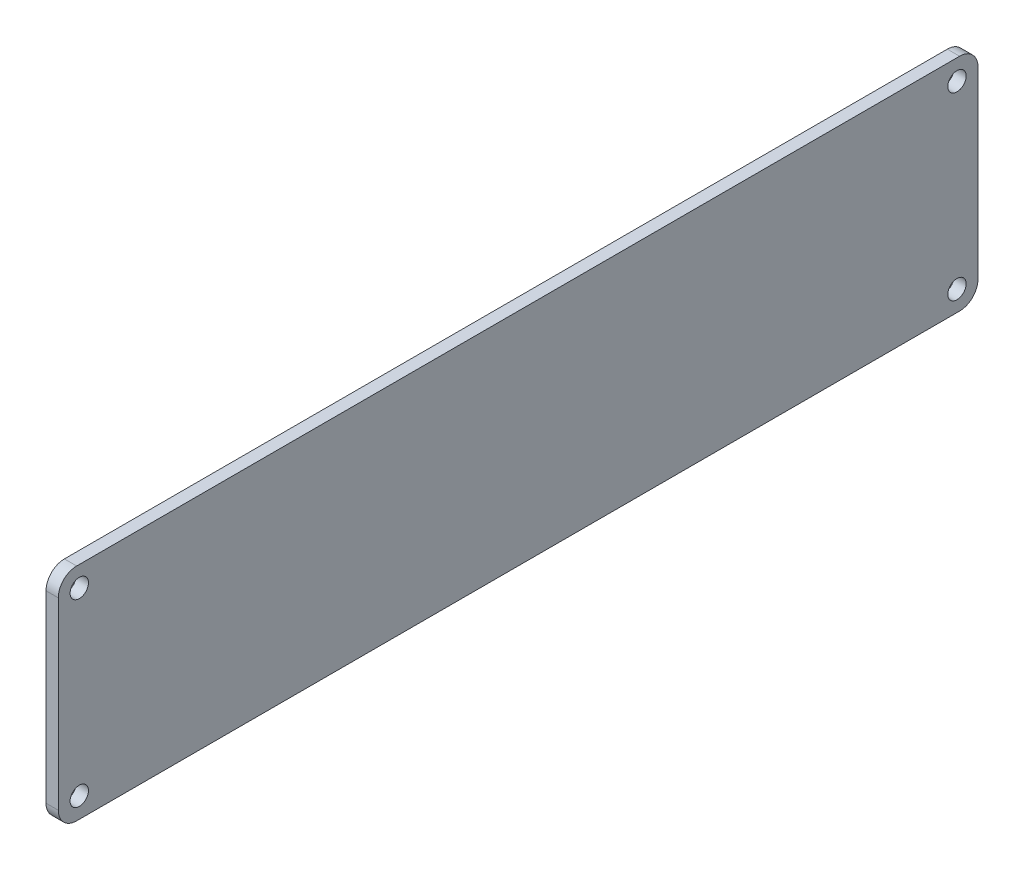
ISO-10303-21;
HEADER;
FILE_DESCRIPTION(('STEP AP214'),'2;1');
FILE_NAME('part.step','',(''),(''),'','','');
FILE_SCHEMA(('AUTOMOTIVE_DESIGN { 1 0 10303 214 1 1 1 1 }'));
ENDSEC;
DATA;
#1=APPLICATION_CONTEXT('core data for automotive mechanical design processes');
#2=APPLICATION_PROTOCOL_DEFINITION('international standard','automotive_design',2000,#1);
#3=PRODUCT_CONTEXT('',#1,'mechanical');
#4=PRODUCT('Part','Part','',(#3));
#5=PRODUCT_RELATED_PRODUCT_CATEGORY('part','',(#4));
#6=PRODUCT_DEFINITION_FORMATION('','',#4);
#7=PRODUCT_DEFINITION_CONTEXT('part definition',#1,'design');
#8=PRODUCT_DEFINITION('design','',#6,#7);
#9=PRODUCT_DEFINITION_SHAPE('','',#8);
#10=(LENGTH_UNIT() NAMED_UNIT(*) SI_UNIT(.MILLI.,.METRE.));
#11=(NAMED_UNIT(*) PLANE_ANGLE_UNIT() SI_UNIT($,.RADIAN.));
#12=(NAMED_UNIT(*) SI_UNIT($,.STERADIAN.) SOLID_ANGLE_UNIT());
#13=UNCERTAINTY_MEASURE_WITH_UNIT(LENGTH_MEASURE(1.E-05),#10,'distance_accuracy_value','');
#14=(GEOMETRIC_REPRESENTATION_CONTEXT(3) GLOBAL_UNCERTAINTY_ASSIGNED_CONTEXT((#13)) GLOBAL_UNIT_ASSIGNED_CONTEXT((#10,
#11,#12)) REPRESENTATION_CONTEXT('',''));
#15=CARTESIAN_POINT('',(0.,0.,0.));
#16=DIRECTION('',(0.,0.,1.));
#17=DIRECTION('',(1.,0.,0.));
#18=AXIS2_PLACEMENT_3D('',#15,#16,#17);
#19=CARTESIAN_POINT('',(2.,18.,-75.));
#20=DIRECTION('',(0.,0.,1.));
#21=DIRECTION('',(1.,0.,0.));
#22=AXIS2_PLACEMENT_3D('',#19,#20,#21);
#23=PLANE('',#22);
#24=DIRECTION('',(0.,1.,0.));
#25=VECTOR('',#24,1.);
#26=CARTESIAN_POINT('',(2.,18.,-75.));
#27=LINE('',#26,#25);
#28=CARTESIAN_POINT('',(2.,-15.,-75.));
#29=VERTEX_POINT('',#28);
#30=CARTESIAN_POINT('',(2.,15.,-75.));
#31=VERTEX_POINT('',#30);
#32=EDGE_CURVE('E133',#29,#31,#27,.T.);
#33=ORIENTED_EDGE('',*,*,#32,.F.);
#34=DIRECTION('',(-1.,0.,0.));
#35=VECTOR('',#34,1.);
#36=CARTESIAN_POINT('',(2.,-15.,-75.));
#37=LINE('',#36,#35);
#38=CARTESIAN_POINT('',(0.,-15.,-75.));
#39=VERTEX_POINT('',#38);
#40=EDGE_CURVE('E117',#29,#39,#37,.T.);
#41=ORIENTED_EDGE('',*,*,#40,.T.);
#42=DIRECTION('',(0.,1.,0.));
#43=VECTOR('',#42,1.);
#44=CARTESIAN_POINT('',(0.,18.,-75.));
#45=LINE('',#44,#43);
#46=CARTESIAN_POINT('',(0.,15.,-75.));
#47=VERTEX_POINT('',#46);
#48=EDGE_CURVE('E130',#39,#47,#45,.T.);
#49=ORIENTED_EDGE('',*,*,#48,.T.);
#50=DIRECTION('',(-1.,0.,0.));
#51=VECTOR('',#50,1.);
#52=CARTESIAN_POINT('',(2.,15.,-75.));
#53=LINE('',#52,#51);
#54=EDGE_CURVE('E136',#47,#31,#53,.F.);
#55=ORIENTED_EDGE('',*,*,#54,.T.);
#56=EDGE_LOOP('',(#33,#41,#49,#55));
#57=FACE_BOUND('',#56,.T.);
#58=ADVANCED_FACE('F47',(#57),#23,.F.);
#59=CARTESIAN_POINT('',(2.,18.,75.));
#60=DIRECTION('',(0.,-1.,0.));
#61=DIRECTION('',(0.,0.,-1.));
#62=AXIS2_PLACEMENT_3D('',#59,#60,#61);
#63=PLANE('',#62);
#64=DIRECTION('',(0.,0.,1.));
#65=VECTOR('',#64,1.);
#66=CARTESIAN_POINT('',(2.,18.,75.));
#67=LINE('',#66,#65);
#68=CARTESIAN_POINT('',(2.,18.,-72.));
#69=VERTEX_POINT('',#68);
#70=CARTESIAN_POINT('',(2.,18.,72.));
#71=VERTEX_POINT('',#70);
#72=EDGE_CURVE('E221',#69,#71,#67,.T.);
#73=ORIENTED_EDGE('',*,*,#72,.F.);
#74=DIRECTION('',(-1.,0.,0.));
#75=VECTOR('',#74,1.);
#76=CARTESIAN_POINT('',(2.,18.,-72.));
#77=LINE('',#76,#75);
#78=CARTESIAN_POINT('',(0.,18.,-72.));
#79=VERTEX_POINT('',#78);
#80=EDGE_CURVE('E201',#69,#79,#77,.T.);
#81=ORIENTED_EDGE('',*,*,#80,.T.);
#82=DIRECTION('',(0.,0.,1.));
#83=VECTOR('',#82,1.);
#84=CARTESIAN_POINT('',(0.,18.,75.));
#85=LINE('',#84,#83);
#86=CARTESIAN_POINT('',(0.,18.,72.));
#87=VERTEX_POINT('',#86);
#88=EDGE_CURVE('E141',#79,#87,#85,.T.);
#89=ORIENTED_EDGE('',*,*,#88,.T.);
#90=DIRECTION('',(-1.,0.,0.));
#91=VECTOR('',#90,1.);
#92=CARTESIAN_POINT('',(2.,18.,72.));
#93=LINE('',#92,#91);
#94=EDGE_CURVE('E198',#87,#71,#93,.F.);
#95=ORIENTED_EDGE('',*,*,#94,.T.);
#96=EDGE_LOOP('',(#73,#81,#89,#95));
#97=FACE_BOUND('',#96,.T.);
#98=ADVANCED_FACE('F268',(#97),#63,.F.);
#99=CARTESIAN_POINT('',(2.,18.,75.));
#100=DIRECTION('',(0.,0.,-1.));
#101=DIRECTION('',(-1.,0.,0.));
#102=AXIS2_PLACEMENT_3D('',#99,#100,#101);
#103=PLANE('',#102);
#104=DIRECTION('',(0.,-1.,0.));
#105=VECTOR('',#104,1.);
#106=CARTESIAN_POINT('',(0.,18.,75.));
#107=LINE('',#106,#105);
#108=CARTESIAN_POINT('',(0.,15.,75.));
#109=VERTEX_POINT('',#108);
#110=CARTESIAN_POINT('',(0.,-15.,75.));
#111=VERTEX_POINT('',#110);
#112=EDGE_CURVE('E147',#109,#111,#107,.T.);
#113=ORIENTED_EDGE('',*,*,#112,.T.);
#114=DIRECTION('',(-1.,0.,0.));
#115=VECTOR('',#114,1.);
#116=CARTESIAN_POINT('',(2.,-15.,75.));
#117=LINE('',#116,#115);
#118=CARTESIAN_POINT('',(2.,-15.,75.));
#119=VERTEX_POINT('',#118);
#120=EDGE_CURVE('E11',#111,#119,#117,.F.);
#121=ORIENTED_EDGE('',*,*,#120,.T.);
#122=DIRECTION('',(0.,-1.,0.));
#123=VECTOR('',#122,1.);
#124=CARTESIAN_POINT('',(2.,18.,75.));
#125=LINE('',#124,#123);
#126=CARTESIAN_POINT('',(2.,15.,75.));
#127=VERTEX_POINT('',#126);
#128=EDGE_CURVE('E209',#127,#119,#125,.T.);
#129=ORIENTED_EDGE('',*,*,#128,.F.);
#130=DIRECTION('',(-1.,0.,0.));
#131=VECTOR('',#130,1.);
#132=CARTESIAN_POINT('',(2.,15.,75.));
#133=LINE('',#132,#131);
#134=EDGE_CURVE('E56',#127,#109,#133,.T.);
#135=ORIENTED_EDGE('',*,*,#134,.T.);
#136=EDGE_LOOP('',(#113,#121,#129,#135));
#137=FACE_BOUND('',#136,.T.);
#138=ADVANCED_FACE('F208',(#137),#103,.F.);
#139=CARTESIAN_POINT('',(2.,-18.,75.));
#140=DIRECTION('',(0.,1.,0.));
#141=DIRECTION('',(0.,0.,1.));
#142=AXIS2_PLACEMENT_3D('',#139,#140,#141);
#143=PLANE('',#142);
#144=DIRECTION('',(0.,0.,-1.));
#145=VECTOR('',#144,1.);
#146=CARTESIAN_POINT('',(0.,-18.,75.));
#147=LINE('',#146,#145);
#148=CARTESIAN_POINT('',(0.,-18.,72.));
#149=VERTEX_POINT('',#148);
#150=CARTESIAN_POINT('',(0.,-18.,-72.));
#151=VERTEX_POINT('',#150);
#152=EDGE_CURVE('E158',#149,#151,#147,.T.);
#153=ORIENTED_EDGE('',*,*,#152,.T.);
#154=DIRECTION('',(-1.,0.,0.));
#155=VECTOR('',#154,1.);
#156=CARTESIAN_POINT('',(2.,-18.,-72.));
#157=LINE('',#156,#155);
#158=CARTESIAN_POINT('',(2.,-18.,-72.));
#159=VERTEX_POINT('',#158);
#160=EDGE_CURVE('E118',#151,#159,#157,.F.);
#161=ORIENTED_EDGE('',*,*,#160,.T.);
#162=DIRECTION('',(0.,0.,-1.));
#163=VECTOR('',#162,1.);
#164=CARTESIAN_POINT('',(2.,-18.,75.));
#165=LINE('',#164,#163);
#166=CARTESIAN_POINT('',(2.,-18.,72.));
#167=VERTEX_POINT('',#166);
#168=EDGE_CURVE('E153',#167,#159,#165,.T.);
#169=ORIENTED_EDGE('',*,*,#168,.F.);
#170=DIRECTION('',(-1.,0.,0.));
#171=VECTOR('',#170,1.);
#172=CARTESIAN_POINT('',(2.,-18.,72.));
#173=LINE('',#172,#171);
#174=EDGE_CURVE('E124',#167,#149,#173,.T.);
#175=ORIENTED_EDGE('',*,*,#174,.T.);
#176=EDGE_LOOP('',(#153,#161,#169,#175));
#177=FACE_BOUND('',#176,.T.);
#178=ADVANCED_FACE('F217',(#177),#143,.F.);
#179=CARTESIAN_POINT('',(2.,0.,0.));
#180=DIRECTION('',(1.,0.,0.));
#181=DIRECTION('',(0.,0.,-1.));
#182=AXIS2_PLACEMENT_3D('',#179,#180,#181);
#183=PLANE('',#182);
#184=CARTESIAN_POINT('',(2.,-14.6788878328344,71.5704353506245));
#185=DIRECTION('',(1.,0.,0.));
#186=DIRECTION('',(0.,0.,1.));
#187=AXIS2_PLACEMENT_3D('',#184,#185,#186);
#188=CIRCLE('',#187,1.5);
#189=CARTESIAN_POINT('',(2.,-14.6788878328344,73.0704353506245));
#190=VERTEX_POINT('',#189);
#191=EDGE_CURVE('E231',#190,#190,#188,.T.);
#192=ORIENTED_EDGE('',*,*,#191,.F.);
#193=EDGE_LOOP('',(#192));
#194=FACE_BOUND('',#193,.T.);
#195=CARTESIAN_POINT('',(2.,-14.6788878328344,-71.5704353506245));
#196=DIRECTION('',(1.,0.,0.));
#197=DIRECTION('',(0.,0.,-1.));
#198=AXIS2_PLACEMENT_3D('',#195,#196,#197);
#199=CIRCLE('',#198,1.5);
#200=CARTESIAN_POINT('',(2.,-14.6788878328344,-73.0704353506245));
#201=VERTEX_POINT('',#200);
#202=EDGE_CURVE('E235',#201,#201,#199,.T.);
#203=ORIENTED_EDGE('',*,*,#202,.F.);
#204=EDGE_LOOP('',(#203));
#205=FACE_BOUND('',#204,.T.);
#206=CARTESIAN_POINT('',(2.,14.6788878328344,-71.5704353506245));
#207=DIRECTION('',(1.,0.,0.));
#208=DIRECTION('',(0.,0.,1.));
#209=AXIS2_PLACEMENT_3D('',#206,#207,#208);
#210=CIRCLE('',#209,1.5);
#211=CARTESIAN_POINT('',(2.,14.6788878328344,-70.0704353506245));
#212=VERTEX_POINT('',#211);
#213=EDGE_CURVE('E230',#212,#212,#210,.T.);
#214=ORIENTED_EDGE('',*,*,#213,.F.);
#215=EDGE_LOOP('',(#214));
#216=FACE_BOUND('',#215,.T.);
#217=CARTESIAN_POINT('',(2.,14.6788878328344,71.5704353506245));
#218=DIRECTION('',(1.,0.,0.));
#219=DIRECTION('',(0.,0.,-1.));
#220=AXIS2_PLACEMENT_3D('',#217,#218,#219);
#221=CIRCLE('',#220,1.5);
#222=CARTESIAN_POINT('',(2.,14.6788878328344,70.0704353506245));
#223=VERTEX_POINT('',#222);
#224=EDGE_CURVE('E166',#223,#223,#221,.T.);
#225=ORIENTED_EDGE('',*,*,#224,.F.);
#226=EDGE_LOOP('',(#225));
#227=FACE_BOUND('',#226,.T.);
#228=ORIENTED_EDGE('',*,*,#168,.T.);
#229=CARTESIAN_POINT('',(2.,-15.,-72.));
#230=DIRECTION('',(1.,0.,0.));
#231=DIRECTION('',(0.,0.,-1.));
#232=AXIS2_PLACEMENT_3D('',#229,#230,#231);
#233=CIRCLE('',#232,3.);
#234=EDGE_CURVE('E195',#159,#29,#233,.T.);
#235=ORIENTED_EDGE('',*,*,#234,.T.);
#236=ORIENTED_EDGE('',*,*,#32,.T.);
#237=CARTESIAN_POINT('',(2.,15.,-72.));
#238=DIRECTION('',(1.,0.,0.));
#239=DIRECTION('',(0.,0.,-1.));
#240=AXIS2_PLACEMENT_3D('',#237,#238,#239);
#241=CIRCLE('',#240,3.);
#242=EDGE_CURVE('E192',#31,#69,#241,.T.);
#243=ORIENTED_EDGE('',*,*,#242,.T.);
#244=ORIENTED_EDGE('',*,*,#72,.T.);
#245=CARTESIAN_POINT('',(2.,15.,72.));
#246=DIRECTION('',(1.,0.,0.));
#247=DIRECTION('',(0.,0.,-1.));
#248=AXIS2_PLACEMENT_3D('',#245,#246,#247);
#249=CIRCLE('',#248,3.);
#250=EDGE_CURVE('E68',#71,#127,#249,.T.);
#251=ORIENTED_EDGE('',*,*,#250,.T.);
#252=ORIENTED_EDGE('',*,*,#128,.T.);
#253=CARTESIAN_POINT('',(2.,-15.,72.));
#254=DIRECTION('',(1.,0.,0.));
#255=DIRECTION('',(0.,0.,-1.));
#256=AXIS2_PLACEMENT_3D('',#253,#254,#255);
#257=CIRCLE('',#256,3.);
#258=EDGE_CURVE('E189',#119,#167,#257,.T.);
#259=ORIENTED_EDGE('',*,*,#258,.T.);
#260=EDGE_LOOP('',(#228,#235,#236,#243,#244,#251,#252,#259));
#261=FACE_BOUND('',#260,.T.);
#262=ADVANCED_FACE('F246',(#194,#205,#216,#227,#261),#183,.T.);
#263=CARTESIAN_POINT('',(0.,0.,0.));
#264=DIRECTION('',(1.,0.,0.));
#265=DIRECTION('',(0.,0.,-1.));
#266=AXIS2_PLACEMENT_3D('',#263,#264,#265);
#267=PLANE('',#266);
#268=CARTESIAN_POINT('',(0.,-14.6788878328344,71.5704353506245));
#269=DIRECTION('',(1.,0.,0.));
#270=DIRECTION('',(0.,0.,-1.));
#271=AXIS2_PLACEMENT_3D('',#268,#269,#270);
#272=CIRCLE('',#271,1.5);
#273=CARTESIAN_POINT('',(0.,-14.6788878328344,70.0704353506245));
#274=VERTEX_POINT('',#273);
#275=EDGE_CURVE('E142',#274,#274,#272,.T.);
#276=ORIENTED_EDGE('',*,*,#275,.T.);
#277=EDGE_LOOP('',(#276));
#278=FACE_BOUND('',#277,.T.);
#279=CARTESIAN_POINT('',(0.,-14.6788878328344,-71.5704353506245));
#280=DIRECTION('',(1.,0.,0.));
#281=DIRECTION('',(0.,0.,-1.));
#282=AXIS2_PLACEMENT_3D('',#279,#280,#281);
#283=CIRCLE('',#282,1.5);
#284=CARTESIAN_POINT('',(0.,-14.6788878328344,-73.0704353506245));
#285=VERTEX_POINT('',#284);
#286=EDGE_CURVE('E150',#285,#285,#283,.T.);
#287=ORIENTED_EDGE('',*,*,#286,.T.);
#288=EDGE_LOOP('',(#287));
#289=FACE_BOUND('',#288,.T.);
#290=CARTESIAN_POINT('',(0.,14.6788878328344,-71.5704353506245));
#291=DIRECTION('',(1.,0.,0.));
#292=DIRECTION('',(0.,0.,-1.));
#293=AXIS2_PLACEMENT_3D('',#290,#291,#292);
#294=CIRCLE('',#293,1.5);
#295=CARTESIAN_POINT('',(0.,14.6788878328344,-73.0704353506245));
#296=VERTEX_POINT('',#295);
#297=EDGE_CURVE('E165',#296,#296,#294,.T.);
#298=ORIENTED_EDGE('',*,*,#297,.T.);
#299=EDGE_LOOP('',(#298));
#300=FACE_BOUND('',#299,.T.);
#301=CARTESIAN_POINT('',(0.,14.6788878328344,71.5704353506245));
#302=DIRECTION('',(1.,0.,0.));
#303=DIRECTION('',(0.,0.,-1.));
#304=AXIS2_PLACEMENT_3D('',#301,#302,#303);
#305=CIRCLE('',#304,1.5);
#306=CARTESIAN_POINT('',(0.,14.6788878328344,70.0704353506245));
#307=VERTEX_POINT('',#306);
#308=EDGE_CURVE('E161',#307,#307,#305,.T.);
#309=ORIENTED_EDGE('',*,*,#308,.T.);
#310=EDGE_LOOP('',(#309));
#311=FACE_BOUND('',#310,.T.);
#312=ORIENTED_EDGE('',*,*,#48,.F.);
#313=CARTESIAN_POINT('',(0.,-15.,-72.));
#314=DIRECTION('',(1.,0.,0.));
#315=DIRECTION('',(0.,0.,-1.));
#316=AXIS2_PLACEMENT_3D('',#313,#314,#315);
#317=CIRCLE('',#316,3.);
#318=EDGE_CURVE('E113',#39,#151,#317,.F.);
#319=ORIENTED_EDGE('',*,*,#318,.T.);
#320=ORIENTED_EDGE('',*,*,#152,.F.);
#321=CARTESIAN_POINT('',(0.,-15.,72.));
#322=DIRECTION('',(1.,0.,0.));
#323=DIRECTION('',(0.,0.,-1.));
#324=AXIS2_PLACEMENT_3D('',#321,#322,#323);
#325=CIRCLE('',#324,3.);
#326=EDGE_CURVE('E177',#149,#111,#325,.F.);
#327=ORIENTED_EDGE('',*,*,#326,.T.);
#328=ORIENTED_EDGE('',*,*,#112,.F.);
#329=CARTESIAN_POINT('',(0.,15.,72.));
#330=DIRECTION('',(1.,0.,0.));
#331=DIRECTION('',(0.,0.,-1.));
#332=AXIS2_PLACEMENT_3D('',#329,#330,#331);
#333=CIRCLE('',#332,3.);
#334=EDGE_CURVE('E135',#109,#87,#333,.F.);
#335=ORIENTED_EDGE('',*,*,#334,.T.);
#336=ORIENTED_EDGE('',*,*,#88,.F.);
#337=CARTESIAN_POINT('',(0.,15.,-72.));
#338=DIRECTION('',(1.,0.,0.));
#339=DIRECTION('',(0.,0.,-1.));
#340=AXIS2_PLACEMENT_3D('',#337,#338,#339);
#341=CIRCLE('',#340,3.);
#342=EDGE_CURVE('E125',#79,#47,#341,.F.);
#343=ORIENTED_EDGE('',*,*,#342,.T.);
#344=EDGE_LOOP('',(#312,#319,#320,#327,#328,#335,#336,#343));
#345=FACE_BOUND('',#344,.T.);
#346=ADVANCED_FACE('F138',(#278,#289,#300,#311,#345),#267,.F.);
#347=CARTESIAN_POINT('',(-10.,14.6788878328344,71.5704353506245));
#348=DIRECTION('',(1.,0.,0.));
#349=DIRECTION('',(0.,0.,-1.));
#350=AXIS2_PLACEMENT_3D('',#347,#348,#349);
#351=CYLINDRICAL_SURFACE('',#350,1.5);
#352=ORIENTED_EDGE('',*,*,#224,.T.);
#353=EDGE_LOOP('',(#352));
#354=FACE_BOUND('',#353,.T.);
#355=ORIENTED_EDGE('',*,*,#308,.F.);
#356=EDGE_LOOP('',(#355));
#357=FACE_BOUND('',#356,.T.);
#358=ADVANCED_FACE('F253',(#354,#357),#351,.F.);
#359=CARTESIAN_POINT('',(-10.,14.6788878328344,-71.5704353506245));
#360=DIRECTION('',(1.,0.,0.));
#361=DIRECTION('',(0.,0.,-1.));
#362=AXIS2_PLACEMENT_3D('',#359,#360,#361);
#363=CYLINDRICAL_SURFACE('',#362,1.5);
#364=ORIENTED_EDGE('',*,*,#213,.T.);
#365=EDGE_LOOP('',(#364));
#366=FACE_BOUND('',#365,.T.);
#367=ORIENTED_EDGE('',*,*,#297,.F.);
#368=EDGE_LOOP('',(#367));
#369=FACE_BOUND('',#368,.T.);
#370=ADVANCED_FACE('F243',(#366,#369),#363,.F.);
#371=CARTESIAN_POINT('',(-10.,-14.6788878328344,-71.5704353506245));
#372=DIRECTION('',(1.,0.,0.));
#373=DIRECTION('',(0.,0.,-1.));
#374=AXIS2_PLACEMENT_3D('',#371,#372,#373);
#375=CYLINDRICAL_SURFACE('',#374,1.5);
#376=ORIENTED_EDGE('',*,*,#202,.T.);
#377=EDGE_LOOP('',(#376));
#378=FACE_BOUND('',#377,.T.);
#379=ORIENTED_EDGE('',*,*,#286,.F.);
#380=EDGE_LOOP('',(#379));
#381=FACE_BOUND('',#380,.T.);
#382=ADVANCED_FACE('F318',(#378,#381),#375,.F.);
#383=CARTESIAN_POINT('',(-10.,-14.6788878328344,71.5704353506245));
#384=DIRECTION('',(1.,0.,0.));
#385=DIRECTION('',(0.,0.,-1.));
#386=AXIS2_PLACEMENT_3D('',#383,#384,#385);
#387=CYLINDRICAL_SURFACE('',#386,1.5);
#388=ORIENTED_EDGE('',*,*,#191,.T.);
#389=EDGE_LOOP('',(#388));
#390=FACE_BOUND('',#389,.T.);
#391=ORIENTED_EDGE('',*,*,#275,.F.);
#392=EDGE_LOOP('',(#391));
#393=FACE_BOUND('',#392,.T.);
#394=ADVANCED_FACE('F280',(#390,#393),#387,.F.);
#395=CARTESIAN_POINT('',(2.,-15.,-72.));
#396=DIRECTION('',(-1.,0.,0.));
#397=DIRECTION('',(0.,0.,1.));
#398=AXIS2_PLACEMENT_3D('',#395,#396,#397);
#399=CYLINDRICAL_SURFACE('',#398,3.);
#400=ORIENTED_EDGE('',*,*,#234,.F.);
#401=ORIENTED_EDGE('',*,*,#160,.F.);
#402=ORIENTED_EDGE('',*,*,#318,.F.);
#403=ORIENTED_EDGE('',*,*,#40,.F.);
#404=EDGE_LOOP('',(#400,#401,#402,#403));
#405=FACE_BOUND('',#404,.T.);
#406=ADVANCED_FACE('F116',(#405),#399,.T.);
#407=CARTESIAN_POINT('',(2.,15.,-72.));
#408=DIRECTION('',(-1.,0.,0.));
#409=DIRECTION('',(0.,0.,1.));
#410=AXIS2_PLACEMENT_3D('',#407,#408,#409);
#411=CYLINDRICAL_SURFACE('',#410,3.);
#412=ORIENTED_EDGE('',*,*,#242,.F.);
#413=ORIENTED_EDGE('',*,*,#54,.F.);
#414=ORIENTED_EDGE('',*,*,#342,.F.);
#415=ORIENTED_EDGE('',*,*,#80,.F.);
#416=EDGE_LOOP('',(#412,#413,#414,#415));
#417=FACE_BOUND('',#416,.T.);
#418=ADVANCED_FACE('F279',(#417),#411,.T.);
#419=CARTESIAN_POINT('',(2.,-15.,72.));
#420=DIRECTION('',(-1.,0.,0.));
#421=DIRECTION('',(0.,0.,1.));
#422=AXIS2_PLACEMENT_3D('',#419,#420,#421);
#423=CYLINDRICAL_SURFACE('',#422,3.);
#424=ORIENTED_EDGE('',*,*,#258,.F.);
#425=ORIENTED_EDGE('',*,*,#120,.F.);
#426=ORIENTED_EDGE('',*,*,#326,.F.);
#427=ORIENTED_EDGE('',*,*,#174,.F.);
#428=EDGE_LOOP('',(#424,#425,#426,#427));
#429=FACE_BOUND('',#428,.T.);
#430=ADVANCED_FACE('F214',(#429),#423,.T.);
#431=CARTESIAN_POINT('',(2.,15.,72.));
#432=DIRECTION('',(-1.,0.,0.));
#433=DIRECTION('',(0.,0.,1.));
#434=AXIS2_PLACEMENT_3D('',#431,#432,#433);
#435=CYLINDRICAL_SURFACE('',#434,3.);
#436=ORIENTED_EDGE('',*,*,#250,.F.);
#437=ORIENTED_EDGE('',*,*,#94,.F.);
#438=ORIENTED_EDGE('',*,*,#334,.F.);
#439=ORIENTED_EDGE('',*,*,#134,.F.);
#440=EDGE_LOOP('',(#436,#437,#438,#439));
#441=FACE_BOUND('',#440,.T.);
#442=ADVANCED_FACE('F49',(#441),#435,.T.);
#443=CLOSED_SHELL('',(#58,#98,#138,#178,#262,#346,#358,#370,#382,#394,#406,#418,#430,#442));
#444=MANIFOLD_SOLID_BREP('B2',#443);
#445=ADVANCED_BREP_SHAPE_REPRESENTATION('',(#18,#444),#14);
#446=SHAPE_DEFINITION_REPRESENTATION(#9,#445);
ENDSEC;
END-ISO-10303-21;
